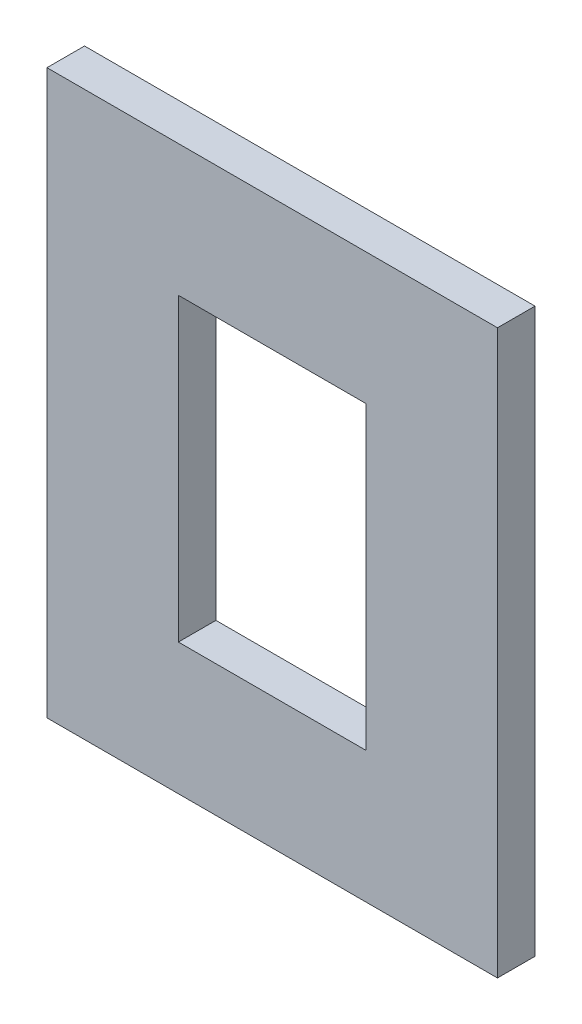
from build123d import *

# Parameters (mm, degrees)
SKETCH2_W           = 152.4
SKETCH2_H           = 190.5
SKETCH2_W_2         = 63.5
SKETCH2_H_2         = 101.6
BOSS_EXTRUDE2_DEPTH = 12.7


with BuildPart() as part:
    # Sketch2 → Boss-Extrude2 (new body)
    with BuildSketch(Plane.XY):
        Rectangle(SKETCH2_W, SKETCH2_H)
        Rectangle(SKETCH2_W_2, SKETCH2_H_2, mode=Mode.SUBTRACT)
    extrude(amount=-BOSS_EXTRUDE2_DEPTH)


solid = part.part
